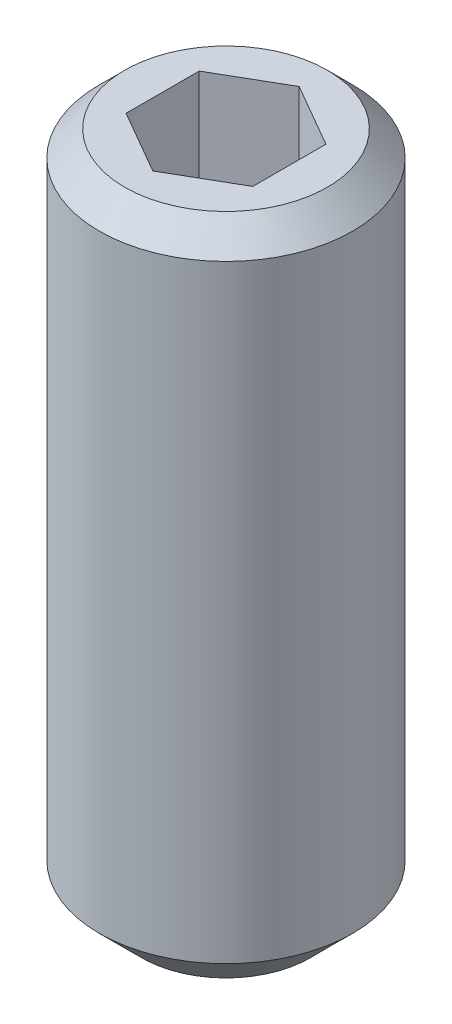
ISO-10303-21;
HEADER;
FILE_DESCRIPTION(('STEP AP214'),'2;1');
FILE_NAME('part.step','',(''),(''),'','','');
FILE_SCHEMA(('AUTOMOTIVE_DESIGN { 1 0 10303 214 1 1 1 1 }'));
ENDSEC;
DATA;
#1=APPLICATION_CONTEXT('core data for automotive mechanical design processes');
#2=APPLICATION_PROTOCOL_DEFINITION('international standard','automotive_design',2000,#1);
#3=PRODUCT_CONTEXT('',#1,'mechanical');
#4=PRODUCT('Part','Part','',(#3));
#5=PRODUCT_RELATED_PRODUCT_CATEGORY('part','',(#4));
#6=PRODUCT_DEFINITION_FORMATION('','',#4);
#7=PRODUCT_DEFINITION_CONTEXT('part definition',#1,'design');
#8=PRODUCT_DEFINITION('design','',#6,#7);
#9=PRODUCT_DEFINITION_SHAPE('','',#8);
#10=(LENGTH_UNIT() NAMED_UNIT(*) SI_UNIT(.MILLI.,.METRE.));
#11=(NAMED_UNIT(*) PLANE_ANGLE_UNIT() SI_UNIT($,.RADIAN.));
#12=(NAMED_UNIT(*) SI_UNIT($,.STERADIAN.) SOLID_ANGLE_UNIT());
#13=UNCERTAINTY_MEASURE_WITH_UNIT(LENGTH_MEASURE(1.E-05),#10,'distance_accuracy_value','');
#14=(GEOMETRIC_REPRESENTATION_CONTEXT(3) GLOBAL_UNCERTAINTY_ASSIGNED_CONTEXT((#13)) GLOBAL_UNIT_ASSIGNED_CONTEXT((#10,
#11,#12)) REPRESENTATION_CONTEXT('',''));
#15=CARTESIAN_POINT('',(0.,0.,0.));
#16=DIRECTION('',(0.,0.,1.));
#17=DIRECTION('',(1.,0.,0.));
#18=AXIS2_PLACEMENT_3D('',#15,#16,#17);
#19=CARTESIAN_POINT('',(0.,-0.300000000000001,0.));
#20=DIRECTION('',(0.,-1.,0.));
#21=DIRECTION('',(0.,0.,-1.));
#22=AXIS2_PLACEMENT_3D('',#19,#20,#21);
#23=CONICAL_SURFACE('',#22,1.5,0.785398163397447);
#24=CARTESIAN_POINT('',(0.,0.,0.));
#25=DIRECTION('',(0.,-1.,0.));
#26=DIRECTION('',(0.,0.,-1.));
#27=AXIS2_PLACEMENT_3D('',#24,#25,#26);
#28=CIRCLE('',#27,1.2);
#29=CARTESIAN_POINT('',(0.,0.,-1.2));
#30=VERTEX_POINT('',#29);
#31=EDGE_CURVE('E11',#30,#30,#28,.T.);
#32=ORIENTED_EDGE('',*,*,#31,.T.);
#33=EDGE_LOOP('',(#32));
#34=FACE_BOUND('',#33,.T.);
#35=CARTESIAN_POINT('',(0.,-0.300000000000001,0.));
#36=DIRECTION('',(0.,-1.,0.));
#37=DIRECTION('',(0.,0.,-1.));
#38=AXIS2_PLACEMENT_3D('',#35,#36,#37);
#39=CIRCLE('',#38,1.5);
#40=CARTESIAN_POINT('',(0.,-0.300000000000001,-1.5));
#41=VERTEX_POINT('',#40);
#42=EDGE_CURVE('E161',#41,#41,#39,.T.);
#43=ORIENTED_EDGE('',*,*,#42,.F.);
#44=EDGE_LOOP('',(#43));
#45=FACE_BOUND('',#44,.T.);
#46=ADVANCED_FACE('F33',(#34,#45),#23,.T.);
#47=CARTESIAN_POINT('',(0.75,0.,0.));
#48=DIRECTION('',(0.,1.,0.));
#49=DIRECTION('',(0.,0.,1.));
#50=AXIS2_PLACEMENT_3D('',#47,#48,#49);
#51=PLANE('',#50);
#52=DIRECTION('',(-0.86602540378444,0.,0.499999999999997));
#53=VECTOR('',#52,1.);
#54=CARTESIAN_POINT('',(-0.75,0.,-0.433012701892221));
#55=LINE('',#54,#53);
#56=CARTESIAN_POINT('',(0.,0.,-0.866025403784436));
#57=VERTEX_POINT('',#56);
#58=CARTESIAN_POINT('',(-0.75,0.,-0.433012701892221));
#59=VERTEX_POINT('',#58);
#60=EDGE_CURVE('E154',#57,#59,#55,.T.);
#61=ORIENTED_EDGE('',*,*,#60,.F.);
#62=DIRECTION('',(-0.86602540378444,0.,-0.499999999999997));
#63=VECTOR('',#62,1.);
#64=CARTESIAN_POINT('',(0.75,0.,-0.433012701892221));
#65=LINE('',#64,#63);
#66=CARTESIAN_POINT('',(0.75,0.,-0.433012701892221));
#67=VERTEX_POINT('',#66);
#68=EDGE_CURVE('E151',#67,#57,#65,.T.);
#69=ORIENTED_EDGE('',*,*,#68,.F.);
#70=DIRECTION('',(0.,0.,-1.));
#71=VECTOR('',#70,1.);
#72=CARTESIAN_POINT('',(0.75,0.,-0.433012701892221));
#73=LINE('',#72,#71);
#74=CARTESIAN_POINT('',(0.75,0.,0.433012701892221));
#75=VERTEX_POINT('',#74);
#76=EDGE_CURVE('E149',#75,#67,#73,.T.);
#77=ORIENTED_EDGE('',*,*,#76,.F.);
#78=DIRECTION('',(0.86602540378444,0.,-0.499999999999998));
#79=VECTOR('',#78,1.);
#80=CARTESIAN_POINT('',(0.75,0.,0.433012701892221));
#81=LINE('',#80,#79);
#82=CARTESIAN_POINT('',(0.,0.,0.866025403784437));
#83=VERTEX_POINT('',#82);
#84=EDGE_CURVE('E147',#83,#75,#81,.T.);
#85=ORIENTED_EDGE('',*,*,#84,.F.);
#86=DIRECTION('',(0.86602540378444,0.,0.499999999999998));
#87=VECTOR('',#86,1.);
#88=CARTESIAN_POINT('',(-0.75,0.,0.433012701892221));
#89=LINE('',#88,#87);
#90=CARTESIAN_POINT('',(-0.75,0.,0.433012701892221));
#91=VERTEX_POINT('',#90);
#92=EDGE_CURVE('E121',#91,#83,#89,.T.);
#93=ORIENTED_EDGE('',*,*,#92,.F.);
#94=DIRECTION('',(0.,0.,1.));
#95=VECTOR('',#94,1.);
#96=CARTESIAN_POINT('',(-0.75,0.,-0.433012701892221));
#97=LINE('',#96,#95);
#98=EDGE_CURVE('E114',#59,#91,#97,.T.);
#99=ORIENTED_EDGE('',*,*,#98,.F.);
#100=EDGE_LOOP('',(#61,#69,#77,#85,#93,#99));
#101=FACE_BOUND('',#100,.T.);
#102=ORIENTED_EDGE('',*,*,#31,.F.);
#103=EDGE_LOOP('',(#102));
#104=FACE_BOUND('',#103,.T.);
#105=ADVANCED_FACE('F228',(#101,#104),#51,.T.);
#106=CARTESIAN_POINT('',(0.,-8.,0.));
#107=DIRECTION('',(0.,-1.,0.));
#108=DIRECTION('',(0.,0.,-1.));
#109=AXIS2_PLACEMENT_3D('',#106,#107,#108);
#110=PLANE('',#109);
#111=CARTESIAN_POINT('',(0.,-8.,0.));
#112=DIRECTION('',(0.,-1.,0.));
#113=DIRECTION('',(0.,0.,-1.));
#114=AXIS2_PLACEMENT_3D('',#111,#112,#113);
#115=CIRCLE('',#114,1.);
#116=CARTESIAN_POINT('',(0.,-8.,-1.));
#117=VERTEX_POINT('',#116);
#118=EDGE_CURVE('E178',#117,#117,#115,.T.);
#119=ORIENTED_EDGE('',*,*,#118,.T.);
#120=EDGE_LOOP('',(#119));
#121=FACE_BOUND('',#120,.T.);
#122=ADVANCED_FACE('F233',(#121),#110,.T.);
#123=CARTESIAN_POINT('',(0.,-8.,0.));
#124=DIRECTION('',(0.,1.,0.));
#125=DIRECTION('',(0.,0.,1.));
#126=AXIS2_PLACEMENT_3D('',#123,#124,#125);
#127=CONICAL_SURFACE('',#126,1.,0.785398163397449);
#128=CARTESIAN_POINT('',(0.,-7.5,0.));
#129=DIRECTION('',(0.,-1.,0.));
#130=DIRECTION('',(0.,0.,-1.));
#131=AXIS2_PLACEMENT_3D('',#128,#129,#130);
#132=CIRCLE('',#131,1.5);
#133=CARTESIAN_POINT('',(0.,-7.5,-1.5));
#134=VERTEX_POINT('',#133);
#135=EDGE_CURVE('E175',#134,#134,#132,.T.);
#136=ORIENTED_EDGE('',*,*,#135,.T.);
#137=EDGE_LOOP('',(#136));
#138=FACE_BOUND('',#137,.T.);
#139=ORIENTED_EDGE('',*,*,#118,.F.);
#140=EDGE_LOOP('',(#139));
#141=FACE_BOUND('',#140,.T.);
#142=ADVANCED_FACE('F242',(#138,#141),#127,.T.);
#143=CARTESIAN_POINT('',(0.,-8.,0.));
#144=DIRECTION('',(0.,-1.,0.));
#145=DIRECTION('',(0.,0.,-1.));
#146=AXIS2_PLACEMENT_3D('',#143,#144,#145);
#147=CYLINDRICAL_SURFACE('',#146,1.5);
#148=ORIENTED_EDGE('',*,*,#42,.T.);
#149=EDGE_LOOP('',(#148));
#150=FACE_BOUND('',#149,.T.);
#151=ORIENTED_EDGE('',*,*,#135,.F.);
#152=EDGE_LOOP('',(#151));
#153=FACE_BOUND('',#152,.T.);
#154=ADVANCED_FACE('F239',(#150,#153),#147,.T.);
#155=CARTESIAN_POINT('',(-0.75,-1.5,0.433012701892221));
#156=DIRECTION('',(-0.499999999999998,0.,0.86602540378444));
#157=DIRECTION('',(0.86602540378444,0.,0.499999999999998));
#158=AXIS2_PLACEMENT_3D('',#155,#156,#157);
#159=PLANE('',#158);
#160=ORIENTED_EDGE('',*,*,#92,.T.);
#161=DIRECTION('',(0.,1.,0.));
#162=VECTOR('',#161,1.);
#163=CARTESIAN_POINT('',(0.,-1.5,0.866025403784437));
#164=LINE('',#163,#162);
#165=CARTESIAN_POINT('',(0.,-1.5,0.866025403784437));
#166=VERTEX_POINT('',#165);
#167=EDGE_CURVE('E118',#166,#83,#164,.T.);
#168=ORIENTED_EDGE('',*,*,#167,.F.);
#169=DIRECTION('',(0.86602540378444,0.,0.499999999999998));
#170=VECTOR('',#169,1.);
#171=CARTESIAN_POINT('',(-0.75,-1.5,0.433012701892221));
#172=LINE('',#171,#170);
#173=CARTESIAN_POINT('',(-0.374999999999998,-1.5,0.64951905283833));
#174=VERTEX_POINT('',#173);
#175=EDGE_CURVE('E103',#174,#166,#172,.T.);
#176=ORIENTED_EDGE('',*,*,#175,.F.);
#177=CARTESIAN_POINT('',(-0.75,-1.5,0.433012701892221));
#178=VERTEX_POINT('',#177);
#179=EDGE_CURVE('E113',#178,#174,#172,.T.);
#180=ORIENTED_EDGE('',*,*,#179,.F.);
#181=DIRECTION('',(0.,1.,0.));
#182=VECTOR('',#181,1.);
#183=CARTESIAN_POINT('',(-0.75,-1.5,0.433012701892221));
#184=LINE('',#183,#182);
#185=EDGE_CURVE('E159',#178,#91,#184,.T.);
#186=ORIENTED_EDGE('',*,*,#185,.T.);
#187=EDGE_LOOP('',(#160,#168,#176,#180,#186));
#188=FACE_BOUND('',#187,.T.);
#189=ADVANCED_FACE('F119',(#188),#159,.F.);
#190=CARTESIAN_POINT('',(-0.75,-1.5,-0.433012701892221));
#191=DIRECTION('',(-1.,0.,0.));
#192=DIRECTION('',(0.,0.,1.));
#193=AXIS2_PLACEMENT_3D('',#190,#191,#192);
#194=PLANE('',#193);
#195=ORIENTED_EDGE('',*,*,#98,.T.);
#196=ORIENTED_EDGE('',*,*,#185,.F.);
#197=DIRECTION('',(0.,0.,1.));
#198=VECTOR('',#197,1.);
#199=CARTESIAN_POINT('',(-0.75,-1.5,-0.433012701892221));
#200=LINE('',#199,#198);
#201=CARTESIAN_POINT('',(-0.749999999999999,-1.5,0.));
#202=VERTEX_POINT('',#201);
#203=EDGE_CURVE('E143',#202,#178,#200,.T.);
#204=ORIENTED_EDGE('',*,*,#203,.F.);
#205=CARTESIAN_POINT('',(-0.75,-1.5,-0.433012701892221));
#206=VERTEX_POINT('',#205);
#207=EDGE_CURVE('E125',#206,#202,#200,.T.);
#208=ORIENTED_EDGE('',*,*,#207,.F.);
#209=DIRECTION('',(0.,1.,0.));
#210=VECTOR('',#209,1.);
#211=CARTESIAN_POINT('',(-0.75,-1.5,-0.433012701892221));
#212=LINE('',#211,#210);
#213=EDGE_CURVE('E162',#206,#59,#212,.T.);
#214=ORIENTED_EDGE('',*,*,#213,.T.);
#215=EDGE_LOOP('',(#195,#196,#204,#208,#214));
#216=FACE_BOUND('',#215,.T.);
#217=ADVANCED_FACE('F200',(#216),#194,.F.);
#218=CARTESIAN_POINT('',(-0.75,-1.5,-0.433012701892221));
#219=DIRECTION('',(-0.499999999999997,0.,-0.86602540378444));
#220=DIRECTION('',(-0.86602540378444,0.,0.499999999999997));
#221=AXIS2_PLACEMENT_3D('',#218,#219,#220);
#222=PLANE('',#221);
#223=ORIENTED_EDGE('',*,*,#60,.T.);
#224=ORIENTED_EDGE('',*,*,#213,.F.);
#225=DIRECTION('',(-0.86602540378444,0.,0.499999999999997));
#226=VECTOR('',#225,1.);
#227=CARTESIAN_POINT('',(-0.75,-1.5,-0.433012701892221));
#228=LINE('',#227,#226);
#229=CARTESIAN_POINT('',(-0.374999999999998,-1.5,-0.64951905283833));
#230=VERTEX_POINT('',#229);
#231=EDGE_CURVE('E141',#230,#206,#228,.T.);
#232=ORIENTED_EDGE('',*,*,#231,.F.);
#233=CARTESIAN_POINT('',(0.,-1.5,-0.866025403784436));
#234=VERTEX_POINT('',#233);
#235=EDGE_CURVE('E47',#234,#230,#228,.T.);
#236=ORIENTED_EDGE('',*,*,#235,.F.);
#237=DIRECTION('',(0.,1.,0.));
#238=VECTOR('',#237,1.);
#239=CARTESIAN_POINT('',(0.,-1.5,-0.866025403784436));
#240=LINE('',#239,#238);
#241=EDGE_CURVE('E165',#234,#57,#240,.T.);
#242=ORIENTED_EDGE('',*,*,#241,.T.);
#243=EDGE_LOOP('',(#223,#224,#232,#236,#242));
#244=FACE_BOUND('',#243,.T.);
#245=ADVANCED_FACE('F264',(#244),#222,.F.);
#246=CARTESIAN_POINT('',(0.75,-1.5,-0.433012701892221));
#247=DIRECTION('',(0.499999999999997,0.,-0.86602540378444));
#248=DIRECTION('',(-0.86602540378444,0.,-0.499999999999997));
#249=AXIS2_PLACEMENT_3D('',#246,#247,#248);
#250=PLANE('',#249);
#251=ORIENTED_EDGE('',*,*,#68,.T.);
#252=ORIENTED_EDGE('',*,*,#241,.F.);
#253=DIRECTION('',(-0.86602540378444,0.,-0.499999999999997));
#254=VECTOR('',#253,1.);
#255=CARTESIAN_POINT('',(0.75,-1.5,-0.433012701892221));
#256=LINE('',#255,#254);
#257=CARTESIAN_POINT('',(0.374999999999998,-1.5,-0.64951905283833));
#258=VERTEX_POINT('',#257);
#259=EDGE_CURVE('E137',#258,#234,#256,.T.);
#260=ORIENTED_EDGE('',*,*,#259,.F.);
#261=CARTESIAN_POINT('',(0.75,-1.5,-0.433012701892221));
#262=VERTEX_POINT('',#261);
#263=EDGE_CURVE('E138',#262,#258,#256,.T.);
#264=ORIENTED_EDGE('',*,*,#263,.F.);
#265=DIRECTION('',(0.,1.,0.));
#266=VECTOR('',#265,1.);
#267=CARTESIAN_POINT('',(0.75,-1.5,-0.433012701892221));
#268=LINE('',#267,#266);
#269=EDGE_CURVE('E168',#262,#67,#268,.T.);
#270=ORIENTED_EDGE('',*,*,#269,.T.);
#271=EDGE_LOOP('',(#251,#252,#260,#264,#270));
#272=FACE_BOUND('',#271,.T.);
#273=ADVANCED_FACE('F214',(#272),#250,.F.);
#274=CARTESIAN_POINT('',(0.75,-1.5,-0.433012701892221));
#275=DIRECTION('',(1.,0.,0.));
#276=DIRECTION('',(0.,0.,-1.));
#277=AXIS2_PLACEMENT_3D('',#274,#275,#276);
#278=PLANE('',#277);
#279=ORIENTED_EDGE('',*,*,#76,.T.);
#280=ORIENTED_EDGE('',*,*,#269,.F.);
#281=DIRECTION('',(0.,0.,-1.));
#282=VECTOR('',#281,1.);
#283=CARTESIAN_POINT('',(0.75,-1.5,-0.433012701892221));
#284=LINE('',#283,#282);
#285=CARTESIAN_POINT('',(0.749999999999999,-1.5,0.));
#286=VERTEX_POINT('',#285);
#287=EDGE_CURVE('E131',#286,#262,#284,.T.);
#288=ORIENTED_EDGE('',*,*,#287,.F.);
#289=CARTESIAN_POINT('',(0.75,-1.5,0.433012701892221));
#290=VERTEX_POINT('',#289);
#291=EDGE_CURVE('E133',#290,#286,#284,.T.);
#292=ORIENTED_EDGE('',*,*,#291,.F.);
#293=DIRECTION('',(0.,1.,0.));
#294=VECTOR('',#293,1.);
#295=CARTESIAN_POINT('',(0.75,-1.5,0.433012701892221));
#296=LINE('',#295,#294);
#297=EDGE_CURVE('E124',#290,#75,#296,.T.);
#298=ORIENTED_EDGE('',*,*,#297,.T.);
#299=EDGE_LOOP('',(#279,#280,#288,#292,#298));
#300=FACE_BOUND('',#299,.T.);
#301=ADVANCED_FACE('F209',(#300),#278,.F.);
#302=CARTESIAN_POINT('',(0.75,-1.5,0.433012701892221));
#303=DIRECTION('',(0.499999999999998,0.,0.86602540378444));
#304=DIRECTION('',(0.86602540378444,0.,-0.499999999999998));
#305=AXIS2_PLACEMENT_3D('',#302,#303,#304);
#306=PLANE('',#305);
#307=ORIENTED_EDGE('',*,*,#84,.T.);
#308=ORIENTED_EDGE('',*,*,#297,.F.);
#309=DIRECTION('',(0.86602540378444,0.,-0.499999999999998));
#310=VECTOR('',#309,1.);
#311=CARTESIAN_POINT('',(0.75,-1.5,0.433012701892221));
#312=LINE('',#311,#310);
#313=CARTESIAN_POINT('',(0.374999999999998,-1.5,0.64951905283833));
#314=VERTEX_POINT('',#313);
#315=EDGE_CURVE('E130',#314,#290,#312,.T.);
#316=ORIENTED_EDGE('',*,*,#315,.F.);
#317=EDGE_CURVE('E107',#166,#314,#312,.T.);
#318=ORIENTED_EDGE('',*,*,#317,.F.);
#319=ORIENTED_EDGE('',*,*,#167,.T.);
#320=EDGE_LOOP('',(#307,#308,#316,#318,#319));
#321=FACE_BOUND('',#320,.T.);
#322=ADVANCED_FACE('F128',(#321),#306,.F.);
#323=CARTESIAN_POINT('',(0.75,-1.5,1.29903810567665));
#324=DIRECTION('',(0.,-1.,0.));
#325=DIRECTION('',(0.,0.,-1.));
#326=AXIS2_PLACEMENT_3D('',#323,#324,#325);
#327=PLANE('',#326);
#328=CARTESIAN_POINT('',(0.,-1.5,0.));
#329=DIRECTION('',(0.,-1.,0.));
#330=DIRECTION('',(0.,0.,-1.));
#331=AXIS2_PLACEMENT_3D('',#328,#329,#330);
#332=CIRCLE('',#331,0.75);
#333=EDGE_CURVE('E40',#258,#286,#332,.T.);
#334=ORIENTED_EDGE('',*,*,#333,.T.);
#335=ORIENTED_EDGE('',*,*,#287,.T.);
#336=ORIENTED_EDGE('',*,*,#263,.T.);
#337=EDGE_LOOP('',(#334,#335,#336));
#338=FACE_BOUND('',#337,.T.);
#339=ADVANCED_FACE('F212',(#338),#327,.F.);
#340=EDGE_CURVE('E181',#286,#314,#332,.T.);
#341=ORIENTED_EDGE('',*,*,#340,.T.);
#342=ORIENTED_EDGE('',*,*,#315,.T.);
#343=ORIENTED_EDGE('',*,*,#291,.T.);
#344=EDGE_LOOP('',(#341,#342,#343));
#345=FACE_BOUND('',#344,.T.);
#346=ADVANCED_FACE('F206',(#345),#327,.F.);
#347=EDGE_CURVE('E109',#314,#174,#332,.T.);
#348=ORIENTED_EDGE('',*,*,#347,.T.);
#349=ORIENTED_EDGE('',*,*,#175,.T.);
#350=ORIENTED_EDGE('',*,*,#317,.T.);
#351=EDGE_LOOP('',(#348,#349,#350));
#352=FACE_BOUND('',#351,.T.);
#353=ADVANCED_FACE('F105',(#352),#327,.F.);
#354=EDGE_CURVE('E189',#174,#202,#332,.T.);
#355=ORIENTED_EDGE('',*,*,#354,.T.);
#356=ORIENTED_EDGE('',*,*,#203,.T.);
#357=ORIENTED_EDGE('',*,*,#179,.T.);
#358=EDGE_LOOP('',(#355,#356,#357));
#359=FACE_BOUND('',#358,.T.);
#360=ADVANCED_FACE('F195',(#359),#327,.F.);
#361=EDGE_CURVE('E185',#202,#230,#332,.T.);
#362=ORIENTED_EDGE('',*,*,#361,.T.);
#363=ORIENTED_EDGE('',*,*,#231,.T.);
#364=ORIENTED_EDGE('',*,*,#207,.T.);
#365=EDGE_LOOP('',(#362,#363,#364));
#366=FACE_BOUND('',#365,.T.);
#367=ADVANCED_FACE('F201',(#366),#327,.F.);
#368=EDGE_CURVE('E180',#230,#258,#332,.T.);
#369=ORIENTED_EDGE('',*,*,#368,.T.);
#370=ORIENTED_EDGE('',*,*,#259,.T.);
#371=ORIENTED_EDGE('',*,*,#235,.T.);
#372=EDGE_LOOP('',(#369,#370,#371));
#373=FACE_BOUND('',#372,.T.);
#374=ADVANCED_FACE('F217',(#373),#327,.F.);
#375=CARTESIAN_POINT('',(0.,-1.5,0.));
#376=DIRECTION('',(0.,1.,0.));
#377=DIRECTION('',(0.,0.,1.));
#378=AXIS2_PLACEMENT_3D('',#375,#376,#377);
#379=CONICAL_SURFACE('',#378,0.75,1.0471975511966);
#380=CARTESIAN_POINT('',(0.,-1.93301270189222,0.));
#381=VERTEX_POINT('',#380);
#382=VERTEX_LOOP('',#381);
#383=FACE_BOUND('',#382,.T.);
#384=ORIENTED_EDGE('',*,*,#333,.F.);
#385=ORIENTED_EDGE('',*,*,#368,.F.);
#386=ORIENTED_EDGE('',*,*,#361,.F.);
#387=ORIENTED_EDGE('',*,*,#354,.F.);
#388=ORIENTED_EDGE('',*,*,#347,.F.);
#389=ORIENTED_EDGE('',*,*,#340,.F.);
#390=EDGE_LOOP('',(#384,#385,#386,#387,#388,#389));
#391=FACE_BOUND('',#390,.T.);
#392=ADVANCED_FACE('F203',(#383,#391),#379,.F.);
#393=CLOSED_SHELL('',(#46,#105,#122,#142,#154,#189,#217,#245,#273,#301,#322,#339,#346,#353,#360,
#367,#374,#392));
#394=MANIFOLD_SOLID_BREP('B2',#393);
#395=ADVANCED_BREP_SHAPE_REPRESENTATION('',(#18,#394),#14);
#396=SHAPE_DEFINITION_REPRESENTATION(#9,#395);
ENDSEC;
END-ISO-10303-21;
